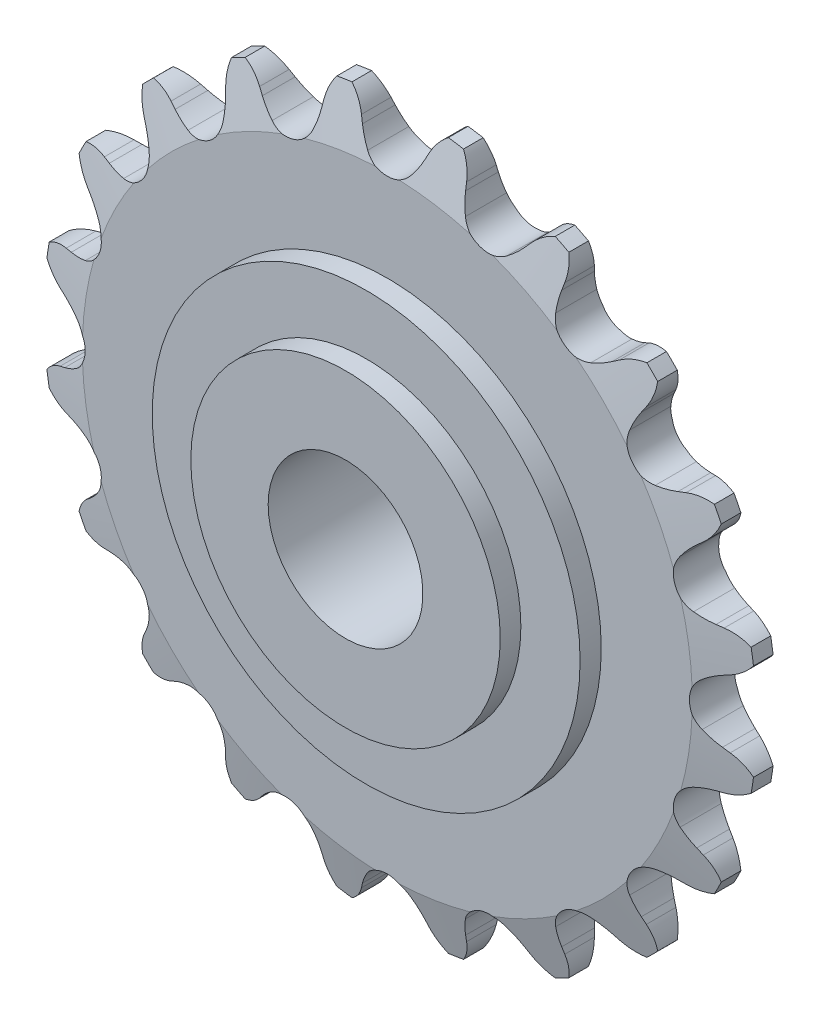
from build123d import *

# Parameters (mm, degrees)
TOOTH_CUT_NUMBER_OF_TEETH_20_DEPTH = 32.075047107
TOOTH_PATTERN_20_20_COUNT          = 20
SKETCH3_W                          = 2.57175
SKETCH3_H                          = 4.7625
SKETCH4_W                          = 2.57175
SKETCH4_H                          = 4.7625
EXTRUDE1_DEPTH                     = 2.69875
EXTRUDE1_DEPTH_BACK                = 2.69875
SKETCH5_R                          = 13.170696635
SKETCH5_R_2                        = 4.7625


with BuildPart() as part:
    # Sprocket-BaseSketch → 25 _04C_ ANSI _ISO_ Chain Number_ 1.598i (revolve)
    with BuildSketch(Plane(origin=(0, 0, 0), x_dir=(0, 0, -1), z_dir=(1, 0, 0)), mode=Mode.PRIVATE) as f_25_04c_ansi_iso_chain_number_1_598i_sk:
        Polygon((1.397, 4.7625), (1.397, 18.776161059), (0.60325, 21.951161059), (-0.60325, 21.951161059), (-1.397, 18.776161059), (-1.397, 4.7625), align=None)
    revolve(f_25_04c_ansi_iso_chain_number_1_598i_sk.sketch.rotate(Axis((0, 0, -5.588), (0, 0, 1)), 90), axis=Axis((0, 0, -5.588), (0, 0, 1)))

    # Tooth-Sketch → Tooth-Cut_ Number of teeth_ 20 (cut, symmetric)
    with BuildSketch(Plane.XY):
        with BuildLine():
            Line((1.918313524, 20.24095764), (2.07723116, 20.619007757))
            ThreePointArc((2.07723116, 20.619007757), (3.071954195, 21.821421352), (4.565885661, 22.272465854))
            ThreePointArc((4.565885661, 22.272465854), (0, 22.735655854), (-4.565885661, 22.272465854))
            ThreePointArc((-4.565885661, 22.272465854), (-3.071954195, 21.821421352), (-2.07723116, 20.619007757))
            Line((-2.07723116, 20.619007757), (-1.918313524, 20.24095764))
            ThreePointArc((-1.918313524, 20.24095764), (-1.660798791, 19.7267126), (-1.337533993, 19.251042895))
            ThreePointArc((-1.337533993, 19.251042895), (0, 18.598683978), (1.337533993, 19.251042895))
            ThreePointArc((1.337533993, 19.251042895), (1.660798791, 19.7267126), (1.918313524, 20.24095764))
        make_face()
    tooth_cut_number_of_teeth_20 = extrude(amount=TOOTH_CUT_NUMBER_OF_TEETH_20_DEPTH, both=True, mode=Mode.SUBTRACT)

    # Tooth Pattern_ 20 _ 20: Tooth-Cut_ Number of teeth_ 20 ×20 about axis
    tooth_pattern_20_20_axis = Axis((0, 0, 0), (0, 0, 1))
    for i in range(1, TOOTH_PATTERN_20_20_COUNT):
        add(tooth_cut_number_of_teeth_20.rotate(tooth_pattern_20_20_axis, i * 360 / TOOTH_PATTERN_20_20_COUNT), mode=Mode.SUBTRACT)

    # Sketch3 → Hub-Revolve1 (revolve)
    with BuildSketch(Plane(origin=(0, 0, 0), x_dir=(0, 0, -1), z_dir=(1, 0, 0)), mode=Mode.PRIVATE) as hub_revolve1_sk:
        with Locations((2.682875, 7.14375)):
            Rectangle(SKETCH3_W, SKETCH3_H)
    revolve(hub_revolve1_sk.sketch.rotate(Axis((0, 0, 2.57175), (0, 0, -1)), 270), axis=Axis((0, 0, 2.57175), (0, 0, -1)))

    # Sketch4 → Hub-Revolve2 (revolve)
    with BuildSketch(Plane(origin=(0, 0, 0), x_dir=(0, 0, -1), z_dir=(1, 0, 0)), mode=Mode.PRIVATE) as hub_revolve2_sk:
        with Locations((-2.682875, 7.14375)):
            Rectangle(SKETCH4_W, SKETCH4_H)
    revolve(hub_revolve2_sk.sketch.rotate(Axis((0, 0, -25.4), (0, 0, 1)), 90), axis=Axis((0, 0, -25.4), (0, 0, 1)))

    # Sketch5 → Extrude1 (add, two sides: drawn at the far end of the back side and taken through both)
    with BuildSketch(Plane.XY.offset(-EXTRUDE1_DEPTH_BACK)):
        Circle(SKETCH5_R)
        with Locations(Location((0, 0, 0), (0, 0, 180))):
            Circle(SKETCH5_R_2, mode=Mode.SUBTRACT)
    extrude(amount=EXTRUDE1_DEPTH + EXTRUDE1_DEPTH_BACK)


solid = part.part
